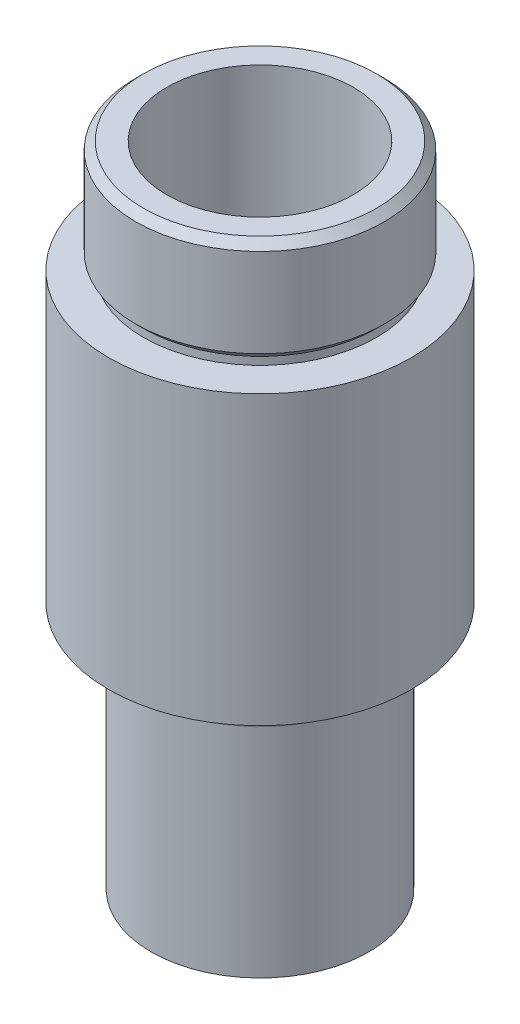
ISO-10303-21;
HEADER;
FILE_DESCRIPTION(('STEP AP214'),'2;1');
FILE_NAME('part.step','',(''),(''),'','','');
FILE_SCHEMA(('AUTOMOTIVE_DESIGN { 1 0 10303 214 1 1 1 1 }'));
ENDSEC;
DATA;
#1=APPLICATION_CONTEXT('core data for automotive mechanical design processes');
#2=APPLICATION_PROTOCOL_DEFINITION('international standard','automotive_design',2000,#1);
#3=PRODUCT_CONTEXT('',#1,'mechanical');
#4=PRODUCT('Part','Part','',(#3));
#5=PRODUCT_RELATED_PRODUCT_CATEGORY('part','',(#4));
#6=PRODUCT_DEFINITION_FORMATION('','',#4);
#7=PRODUCT_DEFINITION_CONTEXT('part definition',#1,'design');
#8=PRODUCT_DEFINITION('design','',#6,#7);
#9=PRODUCT_DEFINITION_SHAPE('','',#8);
#10=(LENGTH_UNIT() NAMED_UNIT(*) SI_UNIT(.MILLI.,.METRE.));
#11=(NAMED_UNIT(*) PLANE_ANGLE_UNIT() SI_UNIT($,.RADIAN.));
#12=(NAMED_UNIT(*) SI_UNIT($,.STERADIAN.) SOLID_ANGLE_UNIT());
#13=UNCERTAINTY_MEASURE_WITH_UNIT(LENGTH_MEASURE(1.E-05),#10,'distance_accuracy_value','');
#14=(GEOMETRIC_REPRESENTATION_CONTEXT(3) GLOBAL_UNCERTAINTY_ASSIGNED_CONTEXT((#13)) GLOBAL_UNIT_ASSIGNED_CONTEXT((#10,
#11,#12)) REPRESENTATION_CONTEXT('',''));
#15=CARTESIAN_POINT('',(0.,0.,0.));
#16=DIRECTION('',(0.,0.,1.));
#17=DIRECTION('',(1.,0.,0.));
#18=AXIS2_PLACEMENT_3D('',#15,#16,#17);
#19=CARTESIAN_POINT('',(9.52500000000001,-13.32865,0.));
#20=DIRECTION('',(0.,-1.,0.));
#21=DIRECTION('',(0.,0.,-1.));
#22=AXIS2_PLACEMENT_3D('',#19,#20,#21);
#23=PLANE('',#22);
#24=CARTESIAN_POINT('',(0.,-13.32865,0.));
#25=DIRECTION('',(0.,-1.,0.));
#26=DIRECTION('',(0.,0.,-1.));
#27=AXIS2_PLACEMENT_3D('',#24,#25,#26);
#28=CIRCLE('',#27,14.2875);
#29=CARTESIAN_POINT('',(0.,-13.32865,-14.2875));
#30=VERTEX_POINT('',#29);
#31=EDGE_CURVE('E9',#30,#30,#28,.F.);
#32=ORIENTED_EDGE('',*,*,#31,.T.);
#33=EDGE_LOOP('',(#32));
#34=FACE_BOUND('',#33,.T.);
#35=CARTESIAN_POINT('',(0.,-13.32865,0.));
#36=DIRECTION('',(0.,-1.,0.));
#37=DIRECTION('',(0.,0.,-1.));
#38=AXIS2_PLACEMENT_3D('',#35,#36,#37);
#39=CIRCLE('',#38,15.4686);
#40=CARTESIAN_POINT('',(0.,-13.32865,-15.4686));
#41=VERTEX_POINT('',#40);
#42=EDGE_CURVE('E61',#41,#41,#39,.T.);
#43=ORIENTED_EDGE('',*,*,#42,.T.);
#44=EDGE_LOOP('',(#43));
#45=FACE_BOUND('',#44,.T.);
#46=ADVANCED_FACE('F14',(#34,#45),#23,.T.);
#47=CARTESIAN_POINT('',(0.,0.,0.));
#48=DIRECTION('',(0.,-1.,0.));
#49=DIRECTION('',(0.,0.,-1.));
#50=AXIS2_PLACEMENT_3D('',#47,#48,#49);
#51=CYLINDRICAL_SURFACE('',#50,15.4686);
#52=CARTESIAN_POINT('',(0.,16.03375,0.));
#53=DIRECTION('',(0.,-1.,0.));
#54=DIRECTION('',(0.,0.,-1.));
#55=AXIS2_PLACEMENT_3D('',#52,#53,#54);
#56=CIRCLE('',#55,15.4686);
#57=CARTESIAN_POINT('',(0.,16.03375,-15.4686));
#58=VERTEX_POINT('',#57);
#59=EDGE_CURVE('E32',#58,#58,#56,.T.);
#60=ORIENTED_EDGE('',*,*,#59,.T.);
#61=EDGE_LOOP('',(#60));
#62=FACE_BOUND('',#61,.T.);
#63=ORIENTED_EDGE('',*,*,#42,.F.);
#64=EDGE_LOOP('',(#63));
#65=FACE_BOUND('',#64,.T.);
#66=ADVANCED_FACE('F103',(#62,#65),#51,.T.);
#67=CARTESIAN_POINT('',(15.4686,16.03375,0.));
#68=DIRECTION('',(0.,1.,0.));
#69=DIRECTION('',(0.,0.,1.));
#70=AXIS2_PLACEMENT_3D('',#67,#68,#69);
#71=PLANE('',#70);
#72=CARTESIAN_POINT('',(0.,16.03375,0.));
#73=DIRECTION('',(0.,-1.,0.));
#74=DIRECTION('',(0.,0.,-1.));
#75=AXIS2_PLACEMENT_3D('',#72,#73,#74);
#76=CIRCLE('',#75,11.90625);
#77=CARTESIAN_POINT('',(0.,16.03375,-11.90625));
#78=VERTEX_POINT('',#77);
#79=EDGE_CURVE('E41',#78,#78,#76,.T.);
#80=ORIENTED_EDGE('',*,*,#79,.T.);
#81=EDGE_LOOP('',(#80));
#82=FACE_BOUND('',#81,.T.);
#83=ORIENTED_EDGE('',*,*,#59,.F.);
#84=EDGE_LOOP('',(#83));
#85=FACE_BOUND('',#84,.T.);
#86=ADVANCED_FACE('F107',(#82,#85),#71,.T.);
#87=CARTESIAN_POINT('',(0.,0.,0.));
#88=DIRECTION('',(0.,-1.,0.));
#89=DIRECTION('',(0.,0.,-1.));
#90=AXIS2_PLACEMENT_3D('',#87,#88,#89);
#91=CYLINDRICAL_SURFACE('',#90,11.90625);
#92=CARTESIAN_POINT('',(0.,16.8275,0.));
#93=DIRECTION('',(0.,-1.,0.));
#94=DIRECTION('',(0.,0.,-1.));
#95=AXIS2_PLACEMENT_3D('',#92,#93,#94);
#96=CIRCLE('',#95,11.90625);
#97=CARTESIAN_POINT('',(0.,16.8275,-11.90625));
#98=VERTEX_POINT('',#97);
#99=EDGE_CURVE('E47',#98,#98,#96,.T.);
#100=ORIENTED_EDGE('',*,*,#99,.T.);
#101=EDGE_LOOP('',(#100));
#102=FACE_BOUND('',#101,.T.);
#103=ORIENTED_EDGE('',*,*,#79,.F.);
#104=EDGE_LOOP('',(#103));
#105=FACE_BOUND('',#104,.T.);
#106=ADVANCED_FACE('F124',(#102,#105),#91,.T.);
#107=CARTESIAN_POINT('',(0.,16.8275,0.));
#108=DIRECTION('',(0.,1.,0.));
#109=DIRECTION('',(0.,0.,1.));
#110=AXIS2_PLACEMENT_3D('',#107,#108,#109);
#111=CONICAL_SURFACE('',#110,11.90625,0.785398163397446);
#112=CARTESIAN_POINT('',(0.,17.62125,0.));
#113=DIRECTION('',(0.,-1.,0.));
#114=DIRECTION('',(0.,0.,-1.));
#115=AXIS2_PLACEMENT_3D('',#112,#113,#114);
#116=CIRCLE('',#115,12.7);
#117=CARTESIAN_POINT('',(0.,17.62125,-12.7));
#118=VERTEX_POINT('',#117);
#119=EDGE_CURVE('E50',#118,#118,#116,.T.);
#120=ORIENTED_EDGE('',*,*,#119,.T.);
#121=EDGE_LOOP('',(#120));
#122=FACE_BOUND('',#121,.T.);
#123=ORIENTED_EDGE('',*,*,#99,.F.);
#124=EDGE_LOOP('',(#123));
#125=FACE_BOUND('',#124,.T.);
#126=ADVANCED_FACE('F120',(#122,#125),#111,.T.);
#127=CARTESIAN_POINT('',(0.,0.,0.));
#128=DIRECTION('',(0.,-1.,0.));
#129=DIRECTION('',(0.,0.,-1.));
#130=AXIS2_PLACEMENT_3D('',#127,#128,#129);
#131=CYLINDRICAL_SURFACE('',#130,12.7);
#132=CARTESIAN_POINT('',(0.,26.67,0.));
#133=DIRECTION('',(0.,-1.,0.));
#134=DIRECTION('',(0.,0.,-1.));
#135=AXIS2_PLACEMENT_3D('',#132,#133,#134);
#136=CIRCLE('',#135,12.7);
#137=CARTESIAN_POINT('',(0.,26.67,-12.7));
#138=VERTEX_POINT('',#137);
#139=EDGE_CURVE('E54',#138,#138,#136,.T.);
#140=ORIENTED_EDGE('',*,*,#139,.T.);
#141=EDGE_LOOP('',(#140));
#142=FACE_BOUND('',#141,.T.);
#143=ORIENTED_EDGE('',*,*,#119,.F.);
#144=EDGE_LOOP('',(#143));
#145=FACE_BOUND('',#144,.T.);
#146=ADVANCED_FACE('F116',(#142,#145),#131,.T.);
#147=CARTESIAN_POINT('',(0.,26.67,0.));
#148=DIRECTION('',(0.,-1.,0.));
#149=DIRECTION('',(0.,0.,-1.));
#150=AXIS2_PLACEMENT_3D('',#147,#148,#149);
#151=CONICAL_SURFACE('',#150,12.7,0.78539816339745);
#152=CARTESIAN_POINT('',(0.,27.46375,0.));
#153=DIRECTION('',(0.,-1.,0.));
#154=DIRECTION('',(0.,0.,-1.));
#155=AXIS2_PLACEMENT_3D('',#152,#153,#154);
#156=CIRCLE('',#155,11.90625);
#157=CARTESIAN_POINT('',(0.,27.46375,-11.90625));
#158=VERTEX_POINT('',#157);
#159=EDGE_CURVE('E58',#158,#158,#156,.T.);
#160=ORIENTED_EDGE('',*,*,#159,.T.);
#161=EDGE_LOOP('',(#160));
#162=FACE_BOUND('',#161,.T.);
#163=ORIENTED_EDGE('',*,*,#139,.F.);
#164=EDGE_LOOP('',(#163));
#165=FACE_BOUND('',#164,.T.);
#166=ADVANCED_FACE('F113',(#162,#165),#151,.T.);
#167=CARTESIAN_POINT('',(11.90625,27.46375,0.));
#168=DIRECTION('',(0.,1.,0.));
#169=DIRECTION('',(0.,0.,1.));
#170=AXIS2_PLACEMENT_3D('',#167,#168,#169);
#171=PLANE('',#170);
#172=CARTESIAN_POINT('',(0.,27.46375,0.));
#173=DIRECTION('',(0.,-1.,0.));
#174=DIRECTION('',(0.,0.,-1.));
#175=AXIS2_PLACEMENT_3D('',#172,#173,#174);
#176=CIRCLE('',#175,9.525);
#177=CARTESIAN_POINT('',(0.,27.46375,-9.525));
#178=VERTEX_POINT('',#177);
#179=EDGE_CURVE('E71',#178,#178,#176,.T.);
#180=ORIENTED_EDGE('',*,*,#179,.T.);
#181=EDGE_LOOP('',(#180));
#182=FACE_BOUND('',#181,.T.);
#183=ORIENTED_EDGE('',*,*,#159,.F.);
#184=EDGE_LOOP('',(#183));
#185=FACE_BOUND('',#184,.T.);
#186=ADVANCED_FACE('F78',(#182,#185),#171,.T.);
#187=CARTESIAN_POINT('',(0.,-38.72865,0.));
#188=DIRECTION('',(0.,-1.,0.));
#189=DIRECTION('',(0.,0.,-1.));
#190=AXIS2_PLACEMENT_3D('',#187,#188,#189);
#191=PLANE('',#190);
#192=CARTESIAN_POINT('',(0.,-38.72865,0.));
#193=DIRECTION('',(0.,-1.,0.));
#194=DIRECTION('',(0.,0.,-1.));
#195=AXIS2_PLACEMENT_3D('',#192,#193,#194);
#196=CIRCLE('',#195,9.52500000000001);
#197=CARTESIAN_POINT('',(0.,-38.72865,-9.52500000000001));
#198=VERTEX_POINT('',#197);
#199=EDGE_CURVE('E68',#198,#198,#196,.T.);
#200=ORIENTED_EDGE('',*,*,#199,.F.);
#201=EDGE_LOOP('',(#200));
#202=FACE_BOUND('',#201,.T.);
#203=CARTESIAN_POINT('',(0.,-38.72865,0.));
#204=DIRECTION('',(0.,-1.,0.));
#205=DIRECTION('',(0.,0.,-1.));
#206=AXIS2_PLACEMENT_3D('',#203,#204,#205);
#207=CIRCLE('',#206,11.1125);
#208=CARTESIAN_POINT('',(0.,-38.72865,-11.1125));
#209=VERTEX_POINT('',#208);
#210=EDGE_CURVE('E64',#209,#209,#207,.T.);
#211=ORIENTED_EDGE('',*,*,#210,.T.);
#212=EDGE_LOOP('',(#211));
#213=FACE_BOUND('',#212,.T.);
#214=ADVANCED_FACE('F87',(#202,#213),#191,.T.);
#215=CARTESIAN_POINT('',(0.,-38.72865,0.));
#216=DIRECTION('',(0.,1.,0.));
#217=DIRECTION('',(0.,0.,1.));
#218=AXIS2_PLACEMENT_3D('',#215,#216,#217);
#219=CYLINDRICAL_SURFACE('',#218,11.1125);
#220=CARTESIAN_POINT('',(0.,-16.50365,0.));
#221=DIRECTION('',(0.,-1.,0.));
#222=DIRECTION('',(0.,0.,-1.));
#223=AXIS2_PLACEMENT_3D('',#220,#221,#222);
#224=CIRCLE('',#223,11.1125);
#225=CARTESIAN_POINT('',(0.,-16.50365,-11.1125));
#226=VERTEX_POINT('',#225);
#227=EDGE_CURVE('E22',#226,#226,#224,.T.);
#228=ORIENTED_EDGE('',*,*,#227,.T.);
#229=EDGE_LOOP('',(#228));
#230=FACE_BOUND('',#229,.T.);
#231=ORIENTED_EDGE('',*,*,#210,.F.);
#232=EDGE_LOOP('',(#231));
#233=FACE_BOUND('',#232,.T.);
#234=ADVANCED_FACE('F90',(#230,#233),#219,.T.);
#235=CARTESIAN_POINT('',(0.,-16.50365,0.));
#236=DIRECTION('',(0.,-1.,0.));
#237=DIRECTION('',(0.,0.,-1.));
#238=AXIS2_PLACEMENT_3D('',#235,#236,#237);
#239=TOROIDAL_SURFACE('',#238,14.2875,3.175);
#240=ORIENTED_EDGE('',*,*,#31,.F.);
#241=EDGE_LOOP('',(#240));
#242=FACE_BOUND('',#241,.T.);
#243=ORIENTED_EDGE('',*,*,#227,.F.);
#244=EDGE_LOOP('',(#243));
#245=FACE_BOUND('',#244,.T.);
#246=ADVANCED_FACE('F16',(#242,#245),#239,.F.);
#247=CARTESIAN_POINT('',(0.,0.,0.));
#248=DIRECTION('',(0.,-1.,0.));
#249=DIRECTION('',(0.,0.,-1.));
#250=AXIS2_PLACEMENT_3D('',#247,#248,#249);
#251=CYLINDRICAL_SURFACE('',#250,9.52500000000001);
#252=ORIENTED_EDGE('',*,*,#179,.F.);
#253=EDGE_LOOP('',(#252));
#254=FACE_BOUND('',#253,.T.);
#255=ORIENTED_EDGE('',*,*,#199,.T.);
#256=EDGE_LOOP('',(#255));
#257=FACE_BOUND('',#256,.T.);
#258=ADVANCED_FACE('F81',(#254,#257),#251,.F.);
#259=CLOSED_SHELL('',(#46,#66,#86,#106,#126,#146,#166,#186,#214,#234,#246,#258));
#260=MANIFOLD_SOLID_BREP('B1',#259);
#261=ADVANCED_BREP_SHAPE_REPRESENTATION('',(#18,#260),#14);
#262=SHAPE_DEFINITION_REPRESENTATION(#9,#261);
ENDSEC;
END-ISO-10303-21;
